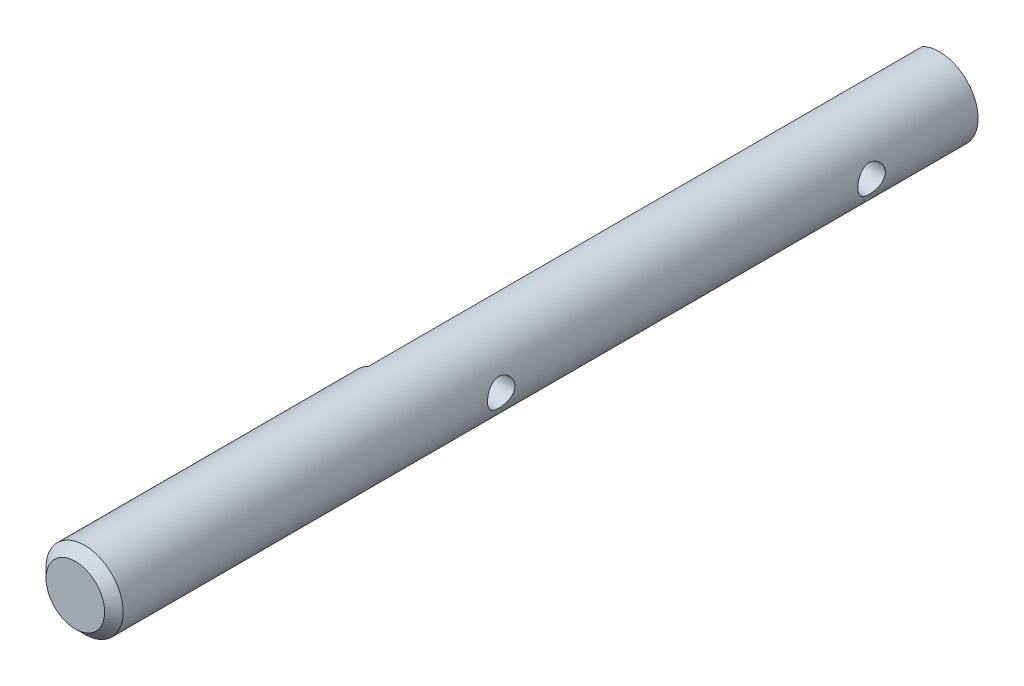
from build123d import *

# Parameters (mm, degrees)
SKETCH1_R               = 3.175
BOSS_EXTRUDE1_DEPTH     = 160.02
CHAMFER1_SIZE           = 0.762
CUT_EXTRUDE1_DEPTH      = 161.082983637
CUT_EXTRUDE1_DEPTH_BACK = 161.082983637
SKETCH2_R               = 1.1303
CUT_EXTRUDE2_START      = -3.175
SKETCH3_W               = 127
SKETCH3_H               = 6.35
CUT_EXTRUDE2_DEPTH      = 1.778
SKETCH4_R               = 3.175
CUT_EXTRUDE3_DEPTH      = 88.9


with BuildPart() as part:
    # Sketch1 → Boss-Extrude1 (new body)
    with BuildSketch(Plane.XY):
        Circle(SKETCH1_R)
    extrude(amount=BOSS_EXTRUDE1_DEPTH)

    # Chamfer1
    chamfer1_edges = [part.edges().sort_by_distance(p)[0] for p in [
        (-3.175, 0, 0),
        (-3.175, 0, 160.02),
    ]]
    chamfer(chamfer1_edges, length=CHAMFER1_SIZE)

    # Sketch2 → Cut-Extrude1 (cut, two sides: drawn at the far end of the back side and taken through both)
    with BuildSketch(Plane(origin=(0, 0, 0), x_dir=(0, 0, -1), z_dir=(1, 0, 0)).offset(-CUT_EXTRUDE1_DEPTH_BACK)):
        with Locations((-13.843, 0)):
            Circle(SKETCH2_R)
        with Locations((-44.323, 0)):
            Circle(SKETCH2_R)
        with Locations((-97.663, 0)):
            Circle(SKETCH2_R)
        with Locations((-128.143, 0)):
            Circle(SKETCH2_R)
    extrude(amount=CUT_EXTRUDE1_DEPTH + CUT_EXTRUDE1_DEPTH_BACK, mode=Mode.SUBTRACT)

    # Sketch3 → Cut-Extrude2 (cut)
    with BuildSketch(Plane(origin=(0, 0, 0), x_dir=(0, 0, -1), z_dir=(1, 0, 0)).offset(CUT_EXTRUDE2_START)):
        with Locations((-70.993, 0)):
            Rectangle(SKETCH3_W, SKETCH3_H)
    extrude(amount=CUT_EXTRUDE2_DEPTH, mode=Mode.SUBTRACT)

    # Sketch4 → Cut-Extrude3 (cut)
    with BuildSketch(Plane(origin=(0, 0, 0), x_dir=(-1, 0, 0), z_dir=(0, 0, -1))):
        Circle(SKETCH4_R)
    extrude(amount=-CUT_EXTRUDE3_DEPTH, mode=Mode.SUBTRACT)


solid = part.part
